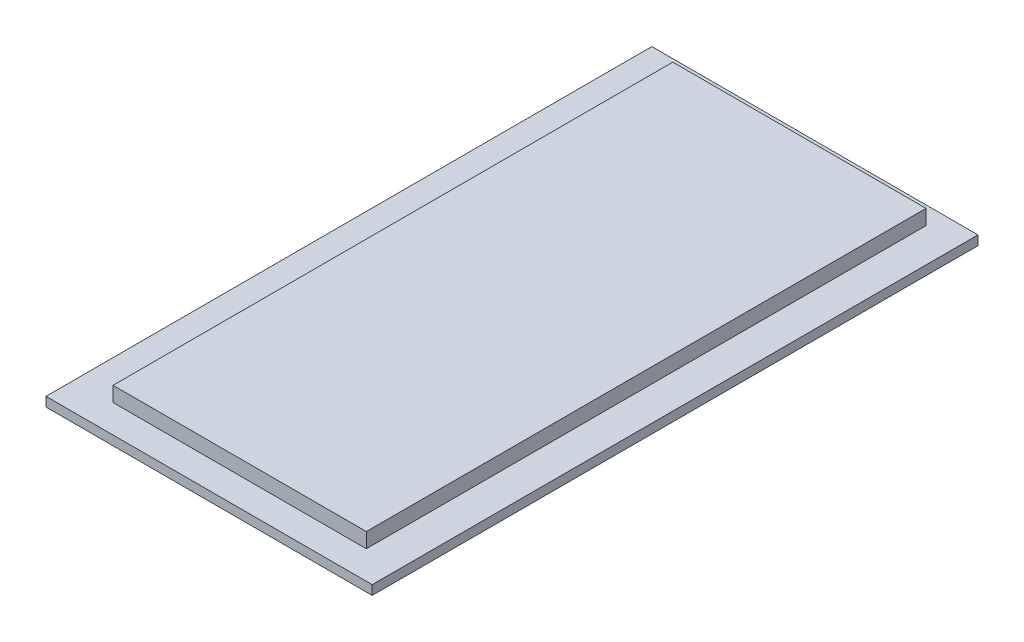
ISO-10303-21;
HEADER;
FILE_DESCRIPTION(('STEP AP214'),'2;1');
FILE_NAME('part.step','',(''),(''),'','','');
FILE_SCHEMA(('AUTOMOTIVE_DESIGN { 1 0 10303 214 1 1 1 1 }'));
ENDSEC;
DATA;
#1=APPLICATION_CONTEXT('core data for automotive mechanical design processes');
#2=APPLICATION_PROTOCOL_DEFINITION('international standard','automotive_design',2000,#1);
#3=PRODUCT_CONTEXT('',#1,'mechanical');
#4=PRODUCT('Part','Part','',(#3));
#5=PRODUCT_RELATED_PRODUCT_CATEGORY('part','',(#4));
#6=PRODUCT_DEFINITION_FORMATION('','',#4);
#7=PRODUCT_DEFINITION_CONTEXT('part definition',#1,'design');
#8=PRODUCT_DEFINITION('design','',#6,#7);
#9=PRODUCT_DEFINITION_SHAPE('','',#8);
#10=(LENGTH_UNIT() NAMED_UNIT(*) SI_UNIT(.MILLI.,.METRE.));
#11=(NAMED_UNIT(*) PLANE_ANGLE_UNIT() SI_UNIT($,.RADIAN.));
#12=(NAMED_UNIT(*) SI_UNIT($,.STERADIAN.) SOLID_ANGLE_UNIT());
#13=UNCERTAINTY_MEASURE_WITH_UNIT(LENGTH_MEASURE(1.E-05),#10,'distance_accuracy_value','');
#14=(GEOMETRIC_REPRESENTATION_CONTEXT(3) GLOBAL_UNCERTAINTY_ASSIGNED_CONTEXT((#13)) GLOBAL_UNIT_ASSIGNED_CONTEXT((#10,
#11,#12)) REPRESENTATION_CONTEXT('',''));
#15=CARTESIAN_POINT('',(0.,0.,0.));
#16=DIRECTION('',(0.,0.,1.));
#17=DIRECTION('',(1.,0.,0.));
#18=AXIS2_PLACEMENT_3D('',#15,#16,#17);
#19=CARTESIAN_POINT('',(0.,2.54,0.));
#20=DIRECTION('',(0.,-1.,0.));
#21=DIRECTION('',(0.,0.,-1.));
#22=AXIS2_PLACEMENT_3D('',#19,#20,#21);
#23=PLANE('',#22);
#24=DIRECTION('',(0.,0.,1.));
#25=VECTOR('',#24,1.);
#26=CARTESIAN_POINT('',(0.,2.54,0.));
#27=LINE('',#26,#25);
#28=CARTESIAN_POINT('',(0.,2.54,-165.1));
#29=VERTEX_POINT('',#28);
#30=CARTESIAN_POINT('',(0.,2.54,0.));
#31=VERTEX_POINT('',#30);
#32=EDGE_CURVE('E145',#29,#31,#27,.T.);
#33=ORIENTED_EDGE('',*,*,#32,.T.);
#34=DIRECTION('',(1.,0.,0.));
#35=VECTOR('',#34,1.);
#36=CARTESIAN_POINT('',(0.,2.54,0.));
#37=LINE('',#36,#35);
#38=CARTESIAN_POINT('',(88.9,2.54,0.));
#39=VERTEX_POINT('',#38);
#40=EDGE_CURVE('E149',#31,#39,#37,.T.);
#41=ORIENTED_EDGE('',*,*,#40,.T.);
#42=DIRECTION('',(0.,0.,-1.));
#43=VECTOR('',#42,1.);
#44=CARTESIAN_POINT('',(88.9,2.54,0.));
#45=LINE('',#44,#43);
#46=CARTESIAN_POINT('',(88.9,2.54,-165.1));
#47=VERTEX_POINT('',#46);
#48=EDGE_CURVE('E153',#39,#47,#45,.T.);
#49=ORIENTED_EDGE('',*,*,#48,.T.);
#50=DIRECTION('',(-1.,0.,0.));
#51=VECTOR('',#50,1.);
#52=CARTESIAN_POINT('',(0.,2.54,-165.1));
#53=LINE('',#52,#51);
#54=EDGE_CURVE('E156',#47,#29,#53,.T.);
#55=ORIENTED_EDGE('',*,*,#54,.T.);
#56=EDGE_LOOP('',(#33,#41,#49,#55));
#57=FACE_BOUND('',#56,.T.);
#58=DIRECTION('',(0.,0.,1.));
#59=VECTOR('',#58,1.);
#60=CARTESIAN_POINT('',(10.5957148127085,2.54,-160.225403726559));
#61=LINE('',#60,#59);
#62=CARTESIAN_POINT('',(10.5957148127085,2.54,-160.225403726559));
#63=VERTEX_POINT('',#62);
#64=CARTESIAN_POINT('',(10.5957148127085,2.54,-7.67519407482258));
#65=VERTEX_POINT('',#64);
#66=EDGE_CURVE('E61',#63,#65,#61,.T.);
#67=ORIENTED_EDGE('',*,*,#66,.F.);
#68=DIRECTION('',(-1.,0.,0.));
#69=VECTOR('',#68,1.);
#70=CARTESIAN_POINT('',(10.5957148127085,2.54,-160.225403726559));
#71=LINE('',#70,#69);
#72=CARTESIAN_POINT('',(79.6222135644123,2.54,-160.225403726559));
#73=VERTEX_POINT('',#72);
#74=EDGE_CURVE('E65',#73,#63,#71,.T.);
#75=ORIENTED_EDGE('',*,*,#74,.F.);
#76=DIRECTION('',(0.,0.,-1.));
#77=VECTOR('',#76,1.);
#78=CARTESIAN_POINT('',(79.6222135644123,2.54,-160.225403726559));
#79=LINE('',#78,#77);
#80=CARTESIAN_POINT('',(79.6222135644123,2.54,-7.67519407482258));
#81=VERTEX_POINT('',#80);
#82=EDGE_CURVE('E311',#81,#73,#79,.T.);
#83=ORIENTED_EDGE('',*,*,#82,.F.);
#84=DIRECTION('',(1.,0.,0.));
#85=VECTOR('',#84,1.);
#86=CARTESIAN_POINT('',(10.5957148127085,2.54,-7.67519407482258));
#87=LINE('',#86,#85);
#88=EDGE_CURVE('E321',#65,#81,#87,.T.);
#89=ORIENTED_EDGE('',*,*,#88,.F.);
#90=EDGE_LOOP('',(#67,#75,#83,#89));
#91=FACE_BOUND('',#90,.T.);
#92=ADVANCED_FACE('F45',(#57,#91),#23,.F.);
#93=CARTESIAN_POINT('',(0.,2.54,0.));
#94=DIRECTION('',(1.,0.,0.));
#95=DIRECTION('',(0.,0.,-1.));
#96=AXIS2_PLACEMENT_3D('',#93,#94,#95);
#97=PLANE('',#96);
#98=DIRECTION('',(0.,0.,1.));
#99=VECTOR('',#98,1.);
#100=CARTESIAN_POINT('',(0.,0.,0.));
#101=LINE('',#100,#99);
#102=CARTESIAN_POINT('',(0.,0.,-165.1));
#103=VERTEX_POINT('',#102);
#104=CARTESIAN_POINT('',(0.,0.,0.));
#105=VERTEX_POINT('',#104);
#106=EDGE_CURVE('E134',#103,#105,#101,.T.);
#107=ORIENTED_EDGE('',*,*,#106,.T.);
#108=DIRECTION('',(0.,-1.,0.));
#109=VECTOR('',#108,1.);
#110=CARTESIAN_POINT('',(0.,2.54,0.));
#111=LINE('',#110,#109);
#112=EDGE_CURVE('E11',#31,#105,#111,.T.);
#113=ORIENTED_EDGE('',*,*,#112,.F.);
#114=ORIENTED_EDGE('',*,*,#32,.F.);
#115=DIRECTION('',(0.,-1.,0.));
#116=VECTOR('',#115,1.);
#117=CARTESIAN_POINT('',(0.,2.54,-165.1));
#118=LINE('',#117,#116);
#119=EDGE_CURVE('E158',#29,#103,#118,.T.);
#120=ORIENTED_EDGE('',*,*,#119,.T.);
#121=EDGE_LOOP('',(#107,#113,#114,#120));
#122=FACE_BOUND('',#121,.T.);
#123=ADVANCED_FACE('F47',(#122),#97,.F.);
#124=CARTESIAN_POINT('',(0.,2.54,0.));
#125=DIRECTION('',(0.,0.,-1.));
#126=DIRECTION('',(-1.,0.,0.));
#127=AXIS2_PLACEMENT_3D('',#124,#125,#126);
#128=PLANE('',#127);
#129=DIRECTION('',(1.,0.,0.));
#130=VECTOR('',#129,1.);
#131=CARTESIAN_POINT('',(0.,0.,0.));
#132=LINE('',#131,#130);
#133=CARTESIAN_POINT('',(88.9,0.,0.));
#134=VERTEX_POINT('',#133);
#135=EDGE_CURVE('E139',#105,#134,#132,.T.);
#136=ORIENTED_EDGE('',*,*,#135,.T.);
#137=DIRECTION('',(0.,-1.,0.));
#138=VECTOR('',#137,1.);
#139=CARTESIAN_POINT('',(88.9,2.54,0.));
#140=LINE('',#139,#138);
#141=EDGE_CURVE('E54',#39,#134,#140,.T.);
#142=ORIENTED_EDGE('',*,*,#141,.F.);
#143=ORIENTED_EDGE('',*,*,#40,.F.);
#144=ORIENTED_EDGE('',*,*,#112,.T.);
#145=EDGE_LOOP('',(#136,#142,#143,#144));
#146=FACE_BOUND('',#145,.T.);
#147=ADVANCED_FACE('F194',(#146),#128,.F.);
#148=CARTESIAN_POINT('',(88.9,2.54,0.));
#149=DIRECTION('',(-1.,0.,0.));
#150=DIRECTION('',(0.,0.,1.));
#151=AXIS2_PLACEMENT_3D('',#148,#149,#150);
#152=PLANE('',#151);
#153=DIRECTION('',(0.,0.,-1.));
#154=VECTOR('',#153,1.);
#155=CARTESIAN_POINT('',(88.9,0.,0.));
#156=LINE('',#155,#154);
#157=CARTESIAN_POINT('',(88.9,0.,-165.1));
#158=VERTEX_POINT('',#157);
#159=EDGE_CURVE('E162',#134,#158,#156,.T.);
#160=ORIENTED_EDGE('',*,*,#159,.T.);
#161=DIRECTION('',(0.,-1.,0.));
#162=VECTOR('',#161,1.);
#163=CARTESIAN_POINT('',(88.9,2.54,-165.1));
#164=LINE('',#163,#162);
#165=EDGE_CURVE('E170',#47,#158,#164,.T.);
#166=ORIENTED_EDGE('',*,*,#165,.F.);
#167=ORIENTED_EDGE('',*,*,#48,.F.);
#168=ORIENTED_EDGE('',*,*,#141,.T.);
#169=EDGE_LOOP('',(#160,#166,#167,#168));
#170=FACE_BOUND('',#169,.T.);
#171=ADVANCED_FACE('F179',(#170),#152,.F.);
#172=CARTESIAN_POINT('',(0.,2.54,-165.1));
#173=DIRECTION('',(0.,0.,1.));
#174=DIRECTION('',(1.,0.,0.));
#175=AXIS2_PLACEMENT_3D('',#172,#173,#174);
#176=PLANE('',#175);
#177=DIRECTION('',(-1.,0.,0.));
#178=VECTOR('',#177,1.);
#179=CARTESIAN_POINT('',(0.,0.,-165.1));
#180=LINE('',#179,#178);
#181=EDGE_CURVE('E150',#158,#103,#180,.T.);
#182=ORIENTED_EDGE('',*,*,#181,.T.);
#183=ORIENTED_EDGE('',*,*,#119,.F.);
#184=ORIENTED_EDGE('',*,*,#54,.F.);
#185=ORIENTED_EDGE('',*,*,#165,.T.);
#186=EDGE_LOOP('',(#182,#183,#184,#185));
#187=FACE_BOUND('',#186,.T.);
#188=ADVANCED_FACE('F188',(#187),#176,.F.);
#189=CARTESIAN_POINT('',(0.,0.,0.));
#190=DIRECTION('',(0.,-1.,0.));
#191=DIRECTION('',(0.,0.,-1.));
#192=AXIS2_PLACEMENT_3D('',#189,#190,#191);
#193=PLANE('',#192);
#194=ORIENTED_EDGE('',*,*,#106,.F.);
#195=ORIENTED_EDGE('',*,*,#181,.F.);
#196=ORIENTED_EDGE('',*,*,#159,.F.);
#197=ORIENTED_EDGE('',*,*,#135,.F.);
#198=EDGE_LOOP('',(#194,#195,#196,#197));
#199=FACE_BOUND('',#198,.T.);
#200=ADVANCED_FACE('F185',(#199),#193,.T.);
#201=CARTESIAN_POINT('',(10.5957148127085,6.604,-160.225403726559));
#202=DIRECTION('',(1.,0.,0.));
#203=DIRECTION('',(0.,0.,-1.));
#204=AXIS2_PLACEMENT_3D('',#201,#202,#203);
#205=PLANE('',#204);
#206=ORIENTED_EDGE('',*,*,#66,.T.);
#207=DIRECTION('',(0.,-1.,0.));
#208=VECTOR('',#207,1.);
#209=CARTESIAN_POINT('',(10.5957148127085,6.604,-7.67519407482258));
#210=LINE('',#209,#208);
#211=CARTESIAN_POINT('',(10.5957148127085,6.604,-7.67519407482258));
#212=VERTEX_POINT('',#211);
#213=EDGE_CURVE('E114',#212,#65,#210,.T.);
#214=ORIENTED_EDGE('',*,*,#213,.F.);
#215=DIRECTION('',(0.,0.,1.));
#216=VECTOR('',#215,1.);
#217=CARTESIAN_POINT('',(10.5957148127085,6.604,-160.225403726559));
#218=LINE('',#217,#216);
#219=CARTESIAN_POINT('',(10.5957148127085,6.604,-160.225403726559));
#220=VERTEX_POINT('',#219);
#221=EDGE_CURVE('E121',#220,#212,#218,.T.);
#222=ORIENTED_EDGE('',*,*,#221,.F.);
#223=DIRECTION('',(0.,-1.,0.));
#224=VECTOR('',#223,1.);
#225=CARTESIAN_POINT('',(10.5957148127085,6.604,-160.225403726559));
#226=LINE('',#225,#224);
#227=EDGE_CURVE('E308',#220,#63,#226,.T.);
#228=ORIENTED_EDGE('',*,*,#227,.T.);
#229=EDGE_LOOP('',(#206,#214,#222,#228));
#230=FACE_BOUND('',#229,.T.);
#231=ADVANCED_FACE('F132',(#230),#205,.F.);
#232=CARTESIAN_POINT('',(10.5957148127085,6.604,-7.67519407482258));
#233=DIRECTION('',(0.,0.,-1.));
#234=DIRECTION('',(-1.,0.,0.));
#235=AXIS2_PLACEMENT_3D('',#232,#233,#234);
#236=PLANE('',#235);
#237=ORIENTED_EDGE('',*,*,#88,.T.);
#238=DIRECTION('',(0.,-1.,0.));
#239=VECTOR('',#238,1.);
#240=CARTESIAN_POINT('',(79.6222135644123,6.604,-7.67519407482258));
#241=LINE('',#240,#239);
#242=CARTESIAN_POINT('',(79.6222135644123,6.604,-7.67519407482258));
#243=VERTEX_POINT('',#242);
#244=EDGE_CURVE('E116',#243,#81,#241,.T.);
#245=ORIENTED_EDGE('',*,*,#244,.F.);
#246=DIRECTION('',(1.,0.,0.));
#247=VECTOR('',#246,1.);
#248=CARTESIAN_POINT('',(10.5957148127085,6.604,-7.67519407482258));
#249=LINE('',#248,#247);
#250=EDGE_CURVE('E109',#212,#243,#249,.T.);
#251=ORIENTED_EDGE('',*,*,#250,.F.);
#252=ORIENTED_EDGE('',*,*,#213,.T.);
#253=EDGE_LOOP('',(#237,#245,#251,#252));
#254=FACE_BOUND('',#253,.T.);
#255=ADVANCED_FACE('F112',(#254),#236,.F.);
#256=CARTESIAN_POINT('',(79.6222135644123,6.604,-160.225403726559));
#257=DIRECTION('',(-1.,0.,0.));
#258=DIRECTION('',(0.,0.,1.));
#259=AXIS2_PLACEMENT_3D('',#256,#257,#258);
#260=PLANE('',#259);
#261=ORIENTED_EDGE('',*,*,#82,.T.);
#262=DIRECTION('',(0.,-1.,0.));
#263=VECTOR('',#262,1.);
#264=CARTESIAN_POINT('',(79.6222135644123,6.604,-160.225403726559));
#265=LINE('',#264,#263);
#266=CARTESIAN_POINT('',(79.6222135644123,6.604,-160.225403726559));
#267=VERTEX_POINT('',#266);
#268=EDGE_CURVE('E141',#267,#73,#265,.T.);
#269=ORIENTED_EDGE('',*,*,#268,.F.);
#270=DIRECTION('',(0.,0.,-1.));
#271=VECTOR('',#270,1.);
#272=CARTESIAN_POINT('',(79.6222135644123,6.604,-160.225403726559));
#273=LINE('',#272,#271);
#274=EDGE_CURVE('E120',#243,#267,#273,.T.);
#275=ORIENTED_EDGE('',*,*,#274,.F.);
#276=ORIENTED_EDGE('',*,*,#244,.T.);
#277=EDGE_LOOP('',(#261,#269,#275,#276));
#278=FACE_BOUND('',#277,.T.);
#279=ADVANCED_FACE('F235',(#278),#260,.F.);
#280=CARTESIAN_POINT('',(10.5957148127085,6.604,-160.225403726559));
#281=DIRECTION('',(0.,0.,1.));
#282=DIRECTION('',(1.,0.,0.));
#283=AXIS2_PLACEMENT_3D('',#280,#281,#282);
#284=PLANE('',#283);
#285=ORIENTED_EDGE('',*,*,#74,.T.);
#286=ORIENTED_EDGE('',*,*,#227,.F.);
#287=DIRECTION('',(-1.,0.,0.));
#288=VECTOR('',#287,1.);
#289=CARTESIAN_POINT('',(10.5957148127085,6.604,-160.225403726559));
#290=LINE('',#289,#288);
#291=EDGE_CURVE('E126',#267,#220,#290,.T.);
#292=ORIENTED_EDGE('',*,*,#291,.F.);
#293=ORIENTED_EDGE('',*,*,#268,.T.);
#294=EDGE_LOOP('',(#285,#286,#292,#293));
#295=FACE_BOUND('',#294,.T.);
#296=ADVANCED_FACE('F241',(#295),#284,.F.);
#297=CARTESIAN_POINT('',(0.,6.604,0.));
#298=DIRECTION('',(0.,1.,0.));
#299=DIRECTION('',(0.,0.,1.));
#300=AXIS2_PLACEMENT_3D('',#297,#298,#299);
#301=PLANE('',#300);
#302=ORIENTED_EDGE('',*,*,#221,.T.);
#303=ORIENTED_EDGE('',*,*,#250,.T.);
#304=ORIENTED_EDGE('',*,*,#274,.T.);
#305=ORIENTED_EDGE('',*,*,#291,.T.);
#306=EDGE_LOOP('',(#302,#303,#304,#305));
#307=FACE_BOUND('',#306,.T.);
#308=ADVANCED_FACE('F124',(#307),#301,.T.);
#309=CLOSED_SHELL('',(#92,#123,#147,#171,#188,#200,#231,#255,#279,#296,#308));
#310=MANIFOLD_SOLID_BREP('B2',#309);
#311=ADVANCED_BREP_SHAPE_REPRESENTATION('',(#18,#310),#14);
#312=SHAPE_DEFINITION_REPRESENTATION(#9,#311);
ENDSEC;
END-ISO-10303-21;
